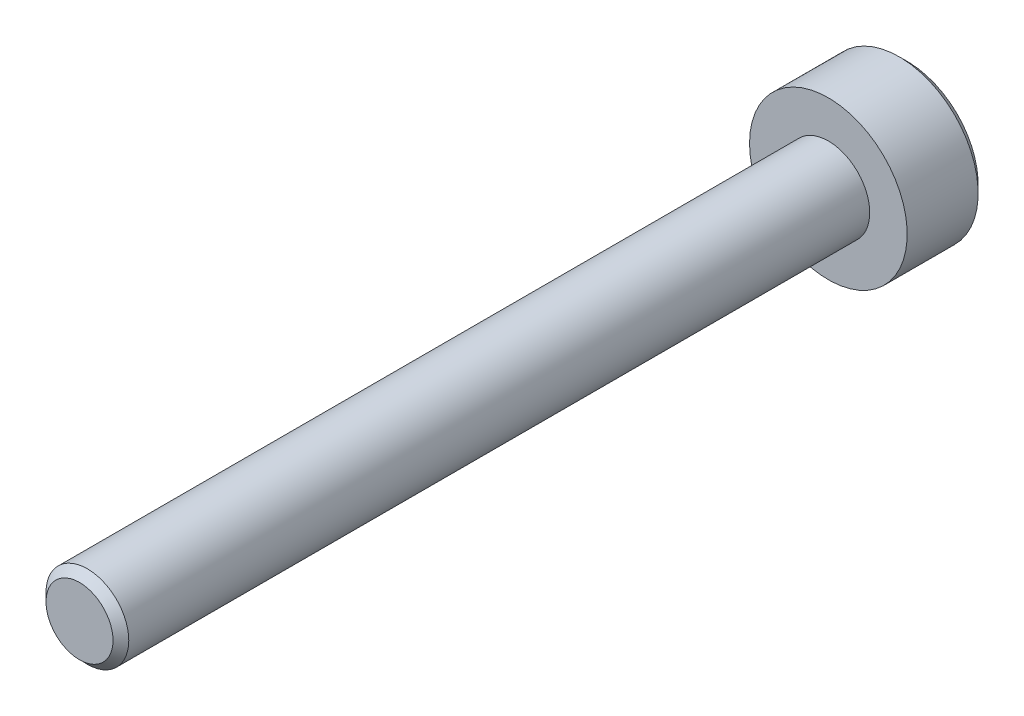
ISO-10303-21;
HEADER;
FILE_DESCRIPTION(('STEP AP214'),'2;1');
FILE_NAME('part.step','',(''),(''),'','','');
FILE_SCHEMA(('AUTOMOTIVE_DESIGN { 1 0 10303 214 1 1 1 1 }'));
ENDSEC;
DATA;
#1=APPLICATION_CONTEXT('core data for automotive mechanical design processes');
#2=APPLICATION_PROTOCOL_DEFINITION('international standard','automotive_design',2000,#1);
#3=PRODUCT_CONTEXT('',#1,'mechanical');
#4=PRODUCT('Part','Part','',(#3));
#5=PRODUCT_RELATED_PRODUCT_CATEGORY('part','',(#4));
#6=PRODUCT_DEFINITION_FORMATION('','',#4);
#7=PRODUCT_DEFINITION_CONTEXT('part definition',#1,'design');
#8=PRODUCT_DEFINITION('design','',#6,#7);
#9=PRODUCT_DEFINITION_SHAPE('','',#8);
#10=(LENGTH_UNIT() NAMED_UNIT(*) SI_UNIT(.MILLI.,.METRE.));
#11=(NAMED_UNIT(*) PLANE_ANGLE_UNIT() SI_UNIT($,.RADIAN.));
#12=(NAMED_UNIT(*) SI_UNIT($,.STERADIAN.) SOLID_ANGLE_UNIT());
#13=UNCERTAINTY_MEASURE_WITH_UNIT(LENGTH_MEASURE(1.E-05),#10,'distance_accuracy_value','');
#14=(GEOMETRIC_REPRESENTATION_CONTEXT(3) GLOBAL_UNCERTAINTY_ASSIGNED_CONTEXT((#13)) GLOBAL_UNIT_ASSIGNED_CONTEXT((#10,
#11,#12)) REPRESENTATION_CONTEXT('',''));
#15=CARTESIAN_POINT('',(0.,0.,0.));
#16=DIRECTION('',(0.,0.,1.));
#17=DIRECTION('',(1.,0.,0.));
#18=AXIS2_PLACEMENT_3D('',#15,#16,#17);
#19=CARTESIAN_POINT('',(0.,0.,95.));
#20=DIRECTION('',(0.,0.,-1.));
#21=DIRECTION('',(-1.,0.,0.));
#22=AXIS2_PLACEMENT_3D('',#19,#20,#21);
#23=CYLINDRICAL_SURFACE('',#22,5.25);
#24=CARTESIAN_POINT('',(0.,0.,94.));
#25=DIRECTION('',(0.,0.,1.));
#26=DIRECTION('',(1.,0.,0.));
#27=AXIS2_PLACEMENT_3D('',#24,#25,#26);
#28=CIRCLE('',#27,5.25);
#29=CARTESIAN_POINT('',(5.25,0.,94.));
#30=VERTEX_POINT('',#29);
#31=EDGE_CURVE('E42',#30,#30,#28,.F.);
#32=ORIENTED_EDGE('',*,*,#31,.T.);
#33=EDGE_LOOP('',(#32));
#34=FACE_BOUND('',#33,.T.);
#35=CARTESIAN_POINT('',(0.,0.,0.));
#36=DIRECTION('',(0.,0.,-1.));
#37=DIRECTION('',(-1.,0.,0.));
#38=AXIS2_PLACEMENT_3D('',#35,#36,#37);
#39=CIRCLE('',#38,5.25);
#40=CARTESIAN_POINT('',(-5.25,0.,0.));
#41=VERTEX_POINT('',#40);
#42=EDGE_CURVE('E51',#41,#41,#39,.T.);
#43=ORIENTED_EDGE('',*,*,#42,.F.);
#44=EDGE_LOOP('',(#43));
#45=FACE_BOUND('',#44,.T.);
#46=ADVANCED_FACE('F31',(#34,#45),#23,.T.);
#47=CARTESIAN_POINT('',(0.,0.,95.));
#48=DIRECTION('',(0.,0.,1.));
#49=DIRECTION('',(1.,0.,0.));
#50=AXIS2_PLACEMENT_3D('',#47,#48,#49);
#51=PLANE('',#50);
#52=CARTESIAN_POINT('',(0.,0.,95.));
#53=DIRECTION('',(0.,0.,1.));
#54=DIRECTION('',(1.,0.,0.));
#55=AXIS2_PLACEMENT_3D('',#52,#53,#54);
#56=CIRCLE('',#55,4.25);
#57=CARTESIAN_POINT('',(4.25,0.,95.));
#58=VERTEX_POINT('',#57);
#59=EDGE_CURVE('E46',#58,#58,#56,.T.);
#60=ORIENTED_EDGE('',*,*,#59,.T.);
#61=EDGE_LOOP('',(#60));
#62=FACE_BOUND('',#61,.T.);
#63=ADVANCED_FACE('F74',(#62),#51,.T.);
#64=CARTESIAN_POINT('',(0.,0.,-10.));
#65=DIRECTION('',(0.,0.,1.));
#66=DIRECTION('',(1.,0.,0.));
#67=AXIS2_PLACEMENT_3D('',#64,#65,#66);
#68=CYLINDRICAL_SURFACE('',#67,10.);
#69=CARTESIAN_POINT('',(0.,0.,-8.99999999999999));
#70=DIRECTION('',(0.,0.,-1.));
#71=DIRECTION('',(-1.,0.,0.));
#72=AXIS2_PLACEMENT_3D('',#69,#70,#71);
#73=CIRCLE('',#72,10.);
#74=CARTESIAN_POINT('',(-10.,0.,-8.99999999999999));
#75=VERTEX_POINT('',#74);
#76=EDGE_CURVE('E10',#75,#75,#73,.F.);
#77=ORIENTED_EDGE('',*,*,#76,.T.);
#78=EDGE_LOOP('',(#77));
#79=FACE_BOUND('',#78,.T.);
#80=CARTESIAN_POINT('',(0.,0.,0.));
#81=DIRECTION('',(0.,0.,-1.));
#82=DIRECTION('',(-1.,0.,0.));
#83=AXIS2_PLACEMENT_3D('',#80,#81,#82);
#84=CIRCLE('',#83,10.);
#85=CARTESIAN_POINT('',(-10.,0.,0.));
#86=VERTEX_POINT('',#85);
#87=EDGE_CURVE('E54',#86,#86,#84,.T.);
#88=ORIENTED_EDGE('',*,*,#87,.T.);
#89=EDGE_LOOP('',(#88));
#90=FACE_BOUND('',#89,.T.);
#91=ADVANCED_FACE('F58',(#79,#90),#68,.T.);
#92=CARTESIAN_POINT('',(0.,0.,-10.));
#93=DIRECTION('',(0.,0.,-1.));
#94=DIRECTION('',(-1.,0.,0.));
#95=AXIS2_PLACEMENT_3D('',#92,#93,#94);
#96=PLANE('',#95);
#97=CARTESIAN_POINT('',(0.,0.,-10.));
#98=DIRECTION('',(0.,0.,-1.));
#99=DIRECTION('',(-1.,0.,0.));
#100=AXIS2_PLACEMENT_3D('',#97,#98,#99);
#101=CIRCLE('',#100,8.99999999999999);
#102=CARTESIAN_POINT('',(-8.99999999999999,0.,-10.));
#103=VERTEX_POINT('',#102);
#104=EDGE_CURVE('E38',#103,#103,#101,.T.);
#105=ORIENTED_EDGE('',*,*,#104,.T.);
#106=EDGE_LOOP('',(#105));
#107=FACE_BOUND('',#106,.T.);
#108=ADVANCED_FACE('F63',(#107),#96,.T.);
#109=CARTESIAN_POINT('',(0.,0.,0.));
#110=DIRECTION('',(0.,0.,-1.));
#111=DIRECTION('',(-1.,0.,0.));
#112=AXIS2_PLACEMENT_3D('',#109,#110,#111);
#113=PLANE('',#112);
#114=ORIENTED_EDGE('',*,*,#42,.T.);
#115=EDGE_LOOP('',(#114));
#116=FACE_BOUND('',#115,.T.);
#117=ORIENTED_EDGE('',*,*,#87,.F.);
#118=EDGE_LOOP('',(#117));
#119=FACE_BOUND('',#118,.T.);
#120=ADVANCED_FACE('F60',(#116,#119),#113,.F.);
#121=CARTESIAN_POINT('',(0.,0.,95.));
#122=DIRECTION('',(0.,0.,-1.));
#123=DIRECTION('',(-1.,0.,0.));
#124=AXIS2_PLACEMENT_3D('',#121,#122,#123);
#125=CONICAL_SURFACE('',#124,4.25,0.785398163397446);
#126=ORIENTED_EDGE('',*,*,#31,.F.);
#127=EDGE_LOOP('',(#126));
#128=FACE_BOUND('',#127,.T.);
#129=ORIENTED_EDGE('',*,*,#59,.F.);
#130=EDGE_LOOP('',(#129));
#131=FACE_BOUND('',#130,.T.);
#132=ADVANCED_FACE('F62',(#128,#131),#125,.T.);
#133=CARTESIAN_POINT('',(0.,0.,-10.));
#134=DIRECTION('',(0.,0.,1.));
#135=DIRECTION('',(1.,0.,0.));
#136=AXIS2_PLACEMENT_3D('',#133,#134,#135);
#137=CONICAL_SURFACE('',#136,8.99999999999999,0.785398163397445);
#138=ORIENTED_EDGE('',*,*,#76,.F.);
#139=EDGE_LOOP('',(#138));
#140=FACE_BOUND('',#139,.T.);
#141=ORIENTED_EDGE('',*,*,#104,.F.);
#142=EDGE_LOOP('',(#141));
#143=FACE_BOUND('',#142,.T.);
#144=ADVANCED_FACE('F33',(#140,#143),#137,.T.);
#145=CLOSED_SHELL('',(#46,#63,#91,#108,#120,#132,#144));
#146=MANIFOLD_SOLID_BREP('B2',#145);
#147=ADVANCED_BREP_SHAPE_REPRESENTATION('',(#18,#146),#14);
#148=SHAPE_DEFINITION_REPRESENTATION(#9,#147);
ENDSEC;
END-ISO-10303-21;
